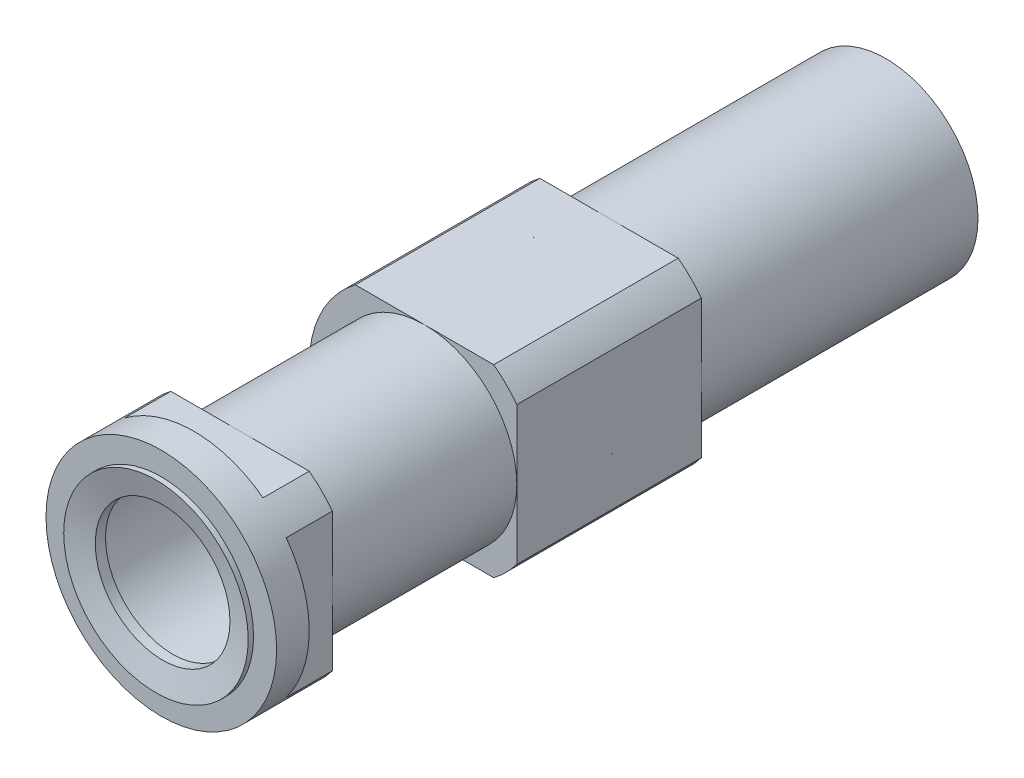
ISO-10303-21;
HEADER;
FILE_DESCRIPTION(('STEP AP214'),'2;1');
FILE_NAME('part.step','',(''),(''),'','','');
FILE_SCHEMA(('AUTOMOTIVE_DESIGN { 1 0 10303 214 1 1 1 1 }'));
ENDSEC;
DATA;
#1=APPLICATION_CONTEXT('core data for automotive mechanical design processes');
#2=APPLICATION_PROTOCOL_DEFINITION('international standard','automotive_design',2000,#1);
#3=PRODUCT_CONTEXT('',#1,'mechanical');
#4=PRODUCT('Part','Part','',(#3));
#5=PRODUCT_RELATED_PRODUCT_CATEGORY('part','',(#4));
#6=PRODUCT_DEFINITION_FORMATION('','',#4);
#7=PRODUCT_DEFINITION_CONTEXT('part definition',#1,'design');
#8=PRODUCT_DEFINITION('design','',#6,#7);
#9=PRODUCT_DEFINITION_SHAPE('','',#8);
#10=(LENGTH_UNIT() NAMED_UNIT(*) SI_UNIT(.MILLI.,.METRE.));
#11=(NAMED_UNIT(*) PLANE_ANGLE_UNIT() SI_UNIT($,.RADIAN.));
#12=(NAMED_UNIT(*) SI_UNIT($,.STERADIAN.) SOLID_ANGLE_UNIT());
#13=UNCERTAINTY_MEASURE_WITH_UNIT(LENGTH_MEASURE(1.E-05),#10,'distance_accuracy_value','');
#14=(GEOMETRIC_REPRESENTATION_CONTEXT(3) GLOBAL_UNCERTAINTY_ASSIGNED_CONTEXT((#13)) GLOBAL_UNIT_ASSIGNED_CONTEXT((#10,
#11,#12)) REPRESENTATION_CONTEXT('',''));
#15=CARTESIAN_POINT('',(0.,0.,0.));
#16=DIRECTION('',(0.,0.,1.));
#17=DIRECTION('',(1.,0.,0.));
#18=AXIS2_PLACEMENT_3D('',#15,#16,#17);
#19=CARTESIAN_POINT('',(0.,0.,63.5));
#20=DIRECTION('',(0.,0.,-1.));
#21=DIRECTION('',(-1.,0.,0.));
#22=AXIS2_PLACEMENT_3D('',#19,#20,#21);
#23=CYLINDRICAL_SURFACE('',#22,15.875);
#24=DIRECTION('',(0.,0.,-1.));
#25=VECTOR('',#24,1.);
#26=CARTESIAN_POINT('',(9.52500000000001,-12.7,82.8127710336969));
#27=LINE('',#26,#25);
#28=CARTESIAN_POINT('',(9.52500000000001,-12.7,63.5));
#29=VERTEX_POINT('',#28);
#30=CARTESIAN_POINT('',(9.52500000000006,-12.7,38.1));
#31=VERTEX_POINT('',#30);
#32=EDGE_CURVE('E181',#29,#31,#27,.T.);
#33=ORIENTED_EDGE('',*,*,#32,.T.);
#34=CARTESIAN_POINT('',(0.,0.,38.1));
#35=DIRECTION('',(0.,0.,-1.));
#36=DIRECTION('',(-1.,0.,0.));
#37=AXIS2_PLACEMENT_3D('',#34,#35,#36);
#38=CIRCLE('',#37,15.875);
#39=CARTESIAN_POINT('',(12.7000000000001,-9.52500000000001,38.1));
#40=VERTEX_POINT('',#39);
#41=EDGE_CURVE('E198',#40,#31,#38,.T.);
#42=ORIENTED_EDGE('',*,*,#41,.F.);
#43=DIRECTION('',(0.,0.,-1.));
#44=VECTOR('',#43,1.);
#45=CARTESIAN_POINT('',(12.7,-9.52500000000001,82.8127710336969));
#46=LINE('',#45,#44);
#47=CARTESIAN_POINT('',(12.7,-9.52500000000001,63.5));
#48=VERTEX_POINT('',#47);
#49=EDGE_CURVE('E323',#48,#40,#46,.T.);
#50=ORIENTED_EDGE('',*,*,#49,.F.);
#51=CARTESIAN_POINT('',(0.,0.,63.5));
#52=DIRECTION('',(0.,0.,-1.));
#53=DIRECTION('',(-1.,0.,0.));
#54=AXIS2_PLACEMENT_3D('',#51,#52,#53);
#55=CIRCLE('',#54,15.875);
#56=EDGE_CURVE('E211',#48,#29,#55,.T.);
#57=ORIENTED_EDGE('',*,*,#56,.T.);
#58=EDGE_LOOP('',(#33,#42,#50,#57));
#59=FACE_BOUND('',#58,.T.);
#60=ADVANCED_FACE('F40',(#59),#23,.T.);
#61=CARTESIAN_POINT('',(0.,0.,63.5));
#62=DIRECTION('',(0.,0.,-1.));
#63=DIRECTION('',(-1.,0.,0.));
#64=AXIS2_PLACEMENT_3D('',#61,#62,#63);
#65=PLANE('',#64);
#66=CARTESIAN_POINT('',(-9.52499999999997,-12.7,63.5000000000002));
#67=VERTEX_POINT('',#66);
#68=CARTESIAN_POINT('',(-9.52499999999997,12.7,63.5000000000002));
#69=VERTEX_POINT('',#68);
#70=EDGE_CURVE('E215',#67,#69,#55,.T.);
#71=ORIENTED_EDGE('',*,*,#70,.F.);
#72=DIRECTION('',(-1.,0.,0.));
#73=VECTOR('',#72,1.);
#74=CARTESIAN_POINT('',(9.52500000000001,-12.7,63.5));
#75=LINE('',#74,#73);
#76=CARTESIAN_POINT('',(0.,-12.7,63.5));
#77=VERTEX_POINT('',#76);
#78=EDGE_CURVE('E177',#77,#67,#75,.T.);
#79=ORIENTED_EDGE('',*,*,#78,.F.);
#80=CARTESIAN_POINT('',(0.,0.,63.5));
#81=DIRECTION('',(0.,0.,-1.));
#82=DIRECTION('',(-1.,0.,0.));
#83=AXIS2_PLACEMENT_3D('',#80,#81,#82);
#84=CIRCLE('',#83,12.7);
#85=CARTESIAN_POINT('',(0.,12.7,63.5));
#86=VERTEX_POINT('',#85);
#87=EDGE_CURVE('E221',#77,#86,#84,.T.);
#88=ORIENTED_EDGE('',*,*,#87,.T.);
#89=DIRECTION('',(1.,0.,0.));
#90=VECTOR('',#89,1.);
#91=CARTESIAN_POINT('',(9.52500000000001,12.7,63.5));
#92=LINE('',#91,#90);
#93=EDGE_CURVE('E332',#69,#86,#92,.T.);
#94=ORIENTED_EDGE('',*,*,#93,.F.);
#95=EDGE_LOOP('',(#71,#79,#88,#94));
#96=FACE_BOUND('',#95,.T.);
#97=ADVANCED_FACE('F376',(#96),#65,.F.);
#98=CARTESIAN_POINT('',(0.,0.,38.1));
#99=DIRECTION('',(0.,0.,-1.));
#100=DIRECTION('',(-1.,0.,0.));
#101=AXIS2_PLACEMENT_3D('',#98,#99,#100);
#102=PLANE('',#101);
#103=DIRECTION('',(1.,0.,0.));
#104=VECTOR('',#103,1.);
#105=CARTESIAN_POINT('',(9.52500000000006,-12.7,38.1));
#106=LINE('',#105,#104);
#107=CARTESIAN_POINT('',(-9.525,-12.7,38.1000000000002));
#108=VERTEX_POINT('',#107);
#109=CARTESIAN_POINT('',(0.,-12.7,38.1));
#110=VERTEX_POINT('',#109);
#111=EDGE_CURVE('E59',#108,#110,#106,.T.);
#112=ORIENTED_EDGE('',*,*,#111,.F.);
#113=CARTESIAN_POINT('',(-9.525,12.7,38.1000000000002));
#114=VERTEX_POINT('',#113);
#115=EDGE_CURVE('E187',#108,#114,#38,.T.);
#116=ORIENTED_EDGE('',*,*,#115,.T.);
#117=DIRECTION('',(-1.,0.,0.));
#118=VECTOR('',#117,1.);
#119=CARTESIAN_POINT('',(9.52500000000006,12.7,38.1));
#120=LINE('',#119,#118);
#121=CARTESIAN_POINT('',(0.,12.7,38.1));
#122=VERTEX_POINT('',#121);
#123=EDGE_CURVE('E340',#122,#114,#120,.T.);
#124=ORIENTED_EDGE('',*,*,#123,.F.);
#125=CARTESIAN_POINT('',(0.,0.,38.1));
#126=DIRECTION('',(0.,0.,-1.));
#127=DIRECTION('',(-1.,0.,0.));
#128=AXIS2_PLACEMENT_3D('',#125,#126,#127);
#129=CIRCLE('',#128,12.7);
#130=EDGE_CURVE('E189',#110,#122,#129,.T.);
#131=ORIENTED_EDGE('',*,*,#130,.F.);
#132=EDGE_LOOP('',(#112,#116,#124,#131));
#133=FACE_BOUND('',#132,.T.);
#134=ADVANCED_FACE('F185',(#133),#102,.T.);
#135=CARTESIAN_POINT('',(9.52500000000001,12.7,63.5));
#136=VERTEX_POINT('',#135);
#137=CARTESIAN_POINT('',(12.7,9.52500000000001,63.5));
#138=VERTEX_POINT('',#137);
#139=EDGE_CURVE('E202',#136,#138,#55,.T.);
#140=ORIENTED_EDGE('',*,*,#139,.F.);
#141=EDGE_CURVE('E67',#86,#136,#92,.T.);
#142=ORIENTED_EDGE('',*,*,#141,.F.);
#143=CARTESIAN_POINT('',(12.7,0.,63.5));
#144=VERTEX_POINT('',#143);
#145=EDGE_CURVE('E222',#86,#144,#84,.T.);
#146=ORIENTED_EDGE('',*,*,#145,.T.);
#147=DIRECTION('',(0.,-1.,0.));
#148=VECTOR('',#147,1.);
#149=CARTESIAN_POINT('',(12.7,9.52500000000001,63.5));
#150=LINE('',#149,#148);
#151=EDGE_CURVE('E316',#138,#144,#150,.T.);
#152=ORIENTED_EDGE('',*,*,#151,.F.);
#153=EDGE_LOOP('',(#140,#142,#146,#152));
#154=FACE_BOUND('',#153,.T.);
#155=ADVANCED_FACE('F369',(#154),#65,.F.);
#156=CARTESIAN_POINT('',(9.52500000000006,12.7,38.1));
#157=VERTEX_POINT('',#156);
#158=EDGE_CURVE('E336',#157,#122,#120,.T.);
#159=ORIENTED_EDGE('',*,*,#158,.F.);
#160=CARTESIAN_POINT('',(12.7000000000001,9.52500000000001,38.1));
#161=VERTEX_POINT('',#160);
#162=EDGE_CURVE('E199',#157,#161,#38,.T.);
#163=ORIENTED_EDGE('',*,*,#162,.T.);
#164=DIRECTION('',(0.,1.,0.));
#165=VECTOR('',#164,1.);
#166=CARTESIAN_POINT('',(12.7000000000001,9.52500000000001,38.1));
#167=LINE('',#166,#165);
#168=CARTESIAN_POINT('',(12.7000000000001,0.,38.1));
#169=VERTEX_POINT('',#168);
#170=EDGE_CURVE('E331',#169,#161,#167,.T.);
#171=ORIENTED_EDGE('',*,*,#170,.F.);
#172=EDGE_CURVE('E214',#122,#169,#129,.T.);
#173=ORIENTED_EDGE('',*,*,#172,.F.);
#174=EDGE_LOOP('',(#159,#163,#171,#173));
#175=FACE_BOUND('',#174,.T.);
#176=ADVANCED_FACE('F361',(#175),#102,.T.);
#177=DIRECTION('',(0.,0.,-1.));
#178=VECTOR('',#177,1.);
#179=CARTESIAN_POINT('',(-9.525,-12.7,82.8127710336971));
#180=LINE('',#179,#178);
#181=EDGE_CURVE('E174',#67,#108,#180,.T.);
#182=ORIENTED_EDGE('',*,*,#181,.F.);
#183=ORIENTED_EDGE('',*,*,#70,.T.);
#184=DIRECTION('',(0.,0.,-1.));
#185=VECTOR('',#184,1.);
#186=CARTESIAN_POINT('',(-9.525,12.7,82.8127710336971));
#187=LINE('',#186,#185);
#188=EDGE_CURVE('E197',#69,#114,#187,.T.);
#189=ORIENTED_EDGE('',*,*,#188,.T.);
#190=ORIENTED_EDGE('',*,*,#115,.F.);
#191=EDGE_LOOP('',(#182,#183,#189,#190));
#192=FACE_BOUND('',#191,.T.);
#193=CARTESIAN_POINT('',(-15.875,0.,57.15));
#194=CARTESIAN_POINT('',(-15.8749992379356,0.170723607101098,57.1499990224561));
#195=CARTESIAN_POINT('',(-15.8722383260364,0.341513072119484,57.1431054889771));
#196=CARTESIAN_POINT('',(-15.8612638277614,0.681883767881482,57.1155934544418));
#197=CARTESIAN_POINT('',(-15.853046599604,0.851464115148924,57.0949657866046));
#198=CARTESIAN_POINT('',(-15.8313537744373,1.18845576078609,57.0401340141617));
#199=CARTESIAN_POINT('',(-15.8178669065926,1.3558616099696,57.0059008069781));
#200=CARTESIAN_POINT('',(-15.7859860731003,1.68699508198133,56.9241852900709));
#201=CARTESIAN_POINT('',(-15.7675901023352,1.85072117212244,56.8766975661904));
#202=CARTESIAN_POINT('',(-15.7264467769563,2.17272777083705,56.7691257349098));
#203=CARTESIAN_POINT('',(-15.7037158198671,2.33102622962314,56.7090890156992));
#204=CARTESIAN_POINT('',(-15.6544202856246,2.64188036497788,56.5768084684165));
#205=CARTESIAN_POINT('',(-15.6278542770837,2.79443387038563,56.5045600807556));
#206=CARTESIAN_POINT('',(-15.5715631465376,3.09274308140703,56.3484905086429));
#207=CARTESIAN_POINT('',(-15.5418404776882,3.23850394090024,56.2646782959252));
#208=CARTESIAN_POINT('',(-15.4799301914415,3.52257915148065,56.0860312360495));
#209=CARTESIAN_POINT('',(-15.4477416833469,3.66089078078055,55.9911923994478));
#210=CARTESIAN_POINT('',(-15.3457887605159,4.07494983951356,55.6825160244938));
#211=CARTESIAN_POINT('',(-15.2731105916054,4.33717782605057,55.4511120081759));
#212=CARTESIAN_POINT('',(-15.1276056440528,4.82027556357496,54.9483793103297));
#213=CARTESIAN_POINT('',(-15.0547788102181,5.04112508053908,54.6770312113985));
#214=CARTESIAN_POINT('',(-14.9497242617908,5.34165986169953,54.2383934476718));
#215=CARTESIAN_POINT('',(-14.9147052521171,5.43842052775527,54.0832303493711));
#216=CARTESIAN_POINT('',(-14.8478282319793,5.61843710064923,53.7646412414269));
#217=CARTESIAN_POINT('',(-14.81596892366,5.70169856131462,53.6012186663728));
#218=CARTESIAN_POINT('',(-14.7564512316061,5.8540128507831,53.2671334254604));
#219=CARTESIAN_POINT('',(-14.7287931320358,5.92306471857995,53.0964702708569));
#220=CARTESIAN_POINT('',(-14.6786563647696,6.04624662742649,52.7491846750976));
#221=CARTESIAN_POINT('',(-14.6561751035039,6.10038414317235,52.5725652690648));
#222=CARTESIAN_POINT('',(-14.6180821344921,6.19109128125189,52.2226969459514));
#223=CARTESIAN_POINT('',(-14.6022072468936,6.22834071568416,52.0496529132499));
#224=CARTESIAN_POINT('',(-14.5764918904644,6.28828888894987,51.7006920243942));
#225=CARTESIAN_POINT('',(-14.5666486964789,6.31099419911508,51.524776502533));
#226=CARTESIAN_POINT('',(-14.5533483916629,6.34160512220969,51.1714581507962));
#227=CARTESIAN_POINT('',(-14.54988993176,6.34951386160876,50.9940556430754));
#228=CARTESIAN_POINT('',(-14.5494847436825,6.35044257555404,50.6392083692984));
#229=CARTESIAN_POINT('',(-14.5525377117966,6.34346324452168,50.461763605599));
#230=CARTESIAN_POINT('',(-14.5646013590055,6.31571187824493,50.1206717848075));
#231=CARTESIAN_POINT('',(-14.5731808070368,6.29593775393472,49.9569270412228));
#232=CARTESIAN_POINT('',(-14.5956012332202,6.24378530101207,49.6317684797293));
#233=CARTESIAN_POINT('',(-14.6094439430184,6.21140282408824,49.4703554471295));
#234=CARTESIAN_POINT('',(-14.641959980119,6.13436035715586,49.1510322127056));
#235=CARTESIAN_POINT('',(-14.6606321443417,6.08970332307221,48.9931211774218));
#236=CARTESIAN_POINT('',(-14.7022643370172,5.9884923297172,48.6816794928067));
#237=CARTESIAN_POINT('',(-14.7252260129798,5.93193379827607,48.5281505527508));
#238=CARTESIAN_POINT('',(-14.775282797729,5.80614447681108,48.223393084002));
#239=CARTESIAN_POINT('',(-14.8024514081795,5.73668280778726,48.0722720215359));
#240=CARTESIAN_POINT('',(-14.8598291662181,5.58637380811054,47.7763465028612));
#241=CARTESIAN_POINT('',(-14.8900393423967,5.5055226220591,47.6315442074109));
#242=CARTESIAN_POINT('',(-14.9527027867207,5.33298475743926,47.3490330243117));
#243=CARTESIAN_POINT('',(-14.9851563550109,5.24129662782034,47.2113250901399));
#244=CARTESIAN_POINT('',(-15.051491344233,5.04764379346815,46.9436964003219));
#245=CARTESIAN_POINT('',(-15.0853728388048,4.94567855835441,46.8137760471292));
#246=CARTESIAN_POINT('',(-15.1564013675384,4.72374065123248,46.5526041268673));
#247=CARTESIAN_POINT('',(-15.1935978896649,4.60298473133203,46.422030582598));
#248=CARTESIAN_POINT('',(-15.2676831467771,4.35094499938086,46.1714638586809));
#249=CARTESIAN_POINT('',(-15.3045719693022,4.21966430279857,46.0514675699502));
#250=CARTESIAN_POINT('',(-15.3770942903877,3.94721120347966,45.8226831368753));
#251=CARTESIAN_POINT('',(-15.4127270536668,3.80603314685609,45.7139014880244));
#252=CARTESIAN_POINT('',(-15.4817555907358,3.51472105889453,45.5084033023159));
#253=CARTESIAN_POINT('',(-15.515152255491,3.36459064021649,45.411681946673));
#254=CARTESIAN_POINT('',(-15.5794769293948,3.05308384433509,45.229145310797));
#255=CARTESIAN_POINT('',(-15.6103411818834,2.89154120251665,45.1435908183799));
#256=CARTESIAN_POINT('',(-15.6679390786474,2.56113556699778,44.9865218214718));
#257=CARTESIAN_POINT('',(-15.6946743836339,2.39227555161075,44.9150016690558));
#258=CARTESIAN_POINT('',(-15.7432461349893,2.04840609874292,44.7866645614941));
#259=CARTESIAN_POINT('',(-15.7650835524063,1.87339788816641,44.7298446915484));
#260=CARTESIAN_POINT('',(-15.8032107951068,1.5185472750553,44.6314990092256));
#261=CARTESIAN_POINT('',(-15.8195010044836,1.33870520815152,44.5899721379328));
#262=CARTESIAN_POINT('',(-15.8452497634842,0.986412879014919,44.524678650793));
#263=CARTESIAN_POINT('',(-15.8550557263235,0.814155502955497,44.5000059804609));
#264=CARTESIAN_POINT('',(-15.8690462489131,0.467973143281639,44.4648784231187));
#265=CARTESIAN_POINT('',(-15.8732310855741,0.294048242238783,44.4544228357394));
#266=CARTESIAN_POINT('',(-15.8758620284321,-0.0540764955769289,44.4478445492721));
#267=CARTESIAN_POINT('',(-15.8743094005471,-0.228276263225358,44.4517186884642));
#268=CARTESIAN_POINT('',(-15.8655117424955,-0.575622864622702,44.4737499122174));
#269=CARTESIAN_POINT('',(-15.858266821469,-0.7487697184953,44.4919067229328));
#270=CARTESIAN_POINT('',(-15.838739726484,-1.08489756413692,44.5411634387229));
#271=CARTESIAN_POINT('',(-15.8266999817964,-1.24798436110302,44.5716413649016));
#272=CARTESIAN_POINT('',(-15.7979139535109,-1.57093270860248,44.6451560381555));
#273=CARTESIAN_POINT('',(-15.7811661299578,-1.73079318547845,44.6881968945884));
#274=CARTESIAN_POINT('',(-15.7433819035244,-2.04615946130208,44.7864318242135));
#275=CARTESIAN_POINT('',(-15.7223466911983,-2.20166645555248,44.8416225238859));
#276=CARTESIAN_POINT('',(-15.6764800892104,-2.50749236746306,44.9637251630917));
#277=CARTESIAN_POINT('',(-15.6516472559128,-2.65780928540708,45.0306415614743));
#278=CARTESIAN_POINT('',(-15.5979717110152,-2.95679977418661,45.1778620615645));
#279=CARTESIAN_POINT('',(-15.5690305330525,-3.10528655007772,45.2585095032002));
#280=CARTESIAN_POINT('',(-15.5084314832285,-3.39500995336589,45.4311217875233));
#281=CARTESIAN_POINT('',(-15.4767726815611,-3.53624407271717,45.5230905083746));
#282=CARTESIAN_POINT('',(-15.4114952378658,-3.81068759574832,45.7177302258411));
#283=CARTESIAN_POINT('',(-15.377876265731,-3.94389564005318,45.8204030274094));
#284=CARTESIAN_POINT('',(-15.3094769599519,-4.20158482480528,46.0358221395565));
#285=CARTESIAN_POINT('',(-15.2746965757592,-4.32606558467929,46.1485688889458));
#286=CARTESIAN_POINT('',(-15.2024813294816,-4.57360830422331,46.3913026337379));
#287=CARTESIAN_POINT('',(-15.1650232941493,-4.69602961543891,46.5219369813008));
#288=CARTESIAN_POINT('',(-15.090762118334,-4.92945473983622,46.7931338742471));
#289=CARTESIAN_POINT('',(-15.0539587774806,-5.04046209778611,46.933693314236));
#290=CARTESIAN_POINT('',(-14.9820123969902,-5.25045310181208,47.224058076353));
#291=CARTESIAN_POINT('',(-14.946870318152,-5.34942984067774,47.3738686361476));
#292=CARTESIAN_POINT('',(-14.8793212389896,-5.53453989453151,47.6817289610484));
#293=CARTESIAN_POINT('',(-14.8469130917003,-5.62067860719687,47.8397752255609));
#294=CARTESIAN_POINT('',(-14.7855120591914,-5.78028102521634,48.1648585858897));
#295=CARTESIAN_POINT('',(-14.7565574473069,-5.85360625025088,48.3319710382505));
#296=CARTESIAN_POINT('',(-14.7034405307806,-5.98577798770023,48.6724897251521));
#297=CARTESIAN_POINT('',(-14.679276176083,-6.04463069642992,48.8458932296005));
#298=CARTESIAN_POINT('',(-14.6365966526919,-6.14725596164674,49.1977181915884));
#299=CARTESIAN_POINT('',(-14.6180792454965,-6.19103449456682,49.3761376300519));
#300=CARTESIAN_POINT('',(-14.5873801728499,-6.26302669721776,49.7366229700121));
#301=CARTESIAN_POINT('',(-14.5751979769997,-6.29124166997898,49.9186885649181));
#302=CARTESIAN_POINT('',(-14.5582759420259,-6.33029550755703,50.2717106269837));
#303=CARTESIAN_POINT('',(-14.5530633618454,-6.34223928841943,50.4425230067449));
#304=CARTESIAN_POINT('',(-14.5486808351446,-6.35228648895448,50.7846294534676));
#305=CARTESIAN_POINT('',(-14.5495106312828,-6.35039049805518,50.9559234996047));
#306=CARTESIAN_POINT('',(-14.5571835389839,-6.33278160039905,51.2976402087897));
#307=CARTESIAN_POINT('',(-14.5640259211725,-6.31707036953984,51.4680629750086));
#308=CARTESIAN_POINT('',(-14.5834872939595,-6.27201114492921,51.8067583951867));
#309=CARTESIAN_POINT('',(-14.596106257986,-6.2426632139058,51.9750310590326));
#310=CARTESIAN_POINT('',(-14.6260871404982,-6.17208269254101,52.3015581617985));
#311=CARTESIAN_POINT('',(-14.6432401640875,-6.13136993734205,52.459944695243));
#312=CARTESIAN_POINT('',(-14.6819761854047,-6.03802553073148,52.7726595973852));
#313=CARTESIAN_POINT('',(-14.7035606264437,-5.98538999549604,52.926986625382));
#314=CARTESIAN_POINT('',(-14.7505437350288,-5.86864882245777,53.2306184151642));
#315=CARTESIAN_POINT('',(-14.7759418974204,-5.80454470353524,53.3799238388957));
#316=CARTESIAN_POINT('',(-14.8298713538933,-5.66534290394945,53.6727524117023));
#317=CARTESIAN_POINT('',(-14.8584037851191,-5.5902412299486,53.816273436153));
#318=CARTESIAN_POINT('',(-14.9510024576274,-5.34003416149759,54.2529865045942));
#319=CARTESIAN_POINT('',(-15.0192861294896,-5.14662610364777,54.5350542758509));
#320=CARTESIAN_POINT('',(-15.1594916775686,-4.71764629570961,55.0640788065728));
#321=CARTESIAN_POINT('',(-15.2314146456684,-4.48206183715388,55.3110249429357));
#322=CARTESIAN_POINT('',(-15.3389694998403,-4.09285023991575,55.6583967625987));
#323=CARTESIAN_POINT('',(-15.3758635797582,-3.95232800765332,55.7733908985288));
#324=CARTESIAN_POINT('',(-15.4476649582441,-3.66164523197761,55.9911263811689));
#325=CARTESIAN_POINT('',(-15.4825729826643,-3.51148825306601,56.0938722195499));
#326=CARTESIAN_POINT('',(-15.5494698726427,-3.20228984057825,56.2864424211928));
#327=CARTESIAN_POINT('',(-15.5814559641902,-3.04324019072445,56.3762545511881));
#328=CARTESIAN_POINT('',(-15.6415591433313,-2.71747396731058,56.5420568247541));
#329=CARTESIAN_POINT('',(-15.6696779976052,-2.55076094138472,56.6180532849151));
#330=CARTESIAN_POINT('',(-15.7207829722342,-2.2138450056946,56.7543101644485));
#331=CARTESIAN_POINT('',(-15.7438529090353,-2.04376017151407,56.814830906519));
#332=CARTESIAN_POINT('',(-15.7848259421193,-1.69855327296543,56.9212759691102));
#333=CARTESIAN_POINT('',(-15.8027314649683,-1.52343361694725,56.9672071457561));
#334=CARTESIAN_POINT('',(-15.8328255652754,-1.16989732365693,57.0439156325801));
#335=CARTESIAN_POINT('',(-15.8450284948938,-0.991490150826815,57.0747309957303));
#336=CARTESIAN_POINT('',(-15.8634123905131,-0.632479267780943,57.1210112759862));
#337=CARTESIAN_POINT('',(-15.8695979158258,-0.451877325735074,57.1364878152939));
#338=CARTESIAN_POINT('',(-15.8734579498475,-0.225838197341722,57.1461438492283));
#339=CARTESIAN_POINT('',(-15.8740359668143,-0.180685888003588,57.1475895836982));
#340=CARTESIAN_POINT('',(-15.8748070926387,-0.090357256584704,57.1495177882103));
#341=CARTESIAN_POINT('',(-15.8750002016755,-0.0451809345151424,57.1500002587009));
#342=CARTESIAN_POINT('',(-15.875,0.,57.15));
#343=B_SPLINE_CURVE_WITH_KNOTS('',3,(#193,#194,#195,#196,#197,#198,#199,#200,#201,#202,#203,
#204,#205,#206,#207,#208,#209,#210,#211,#212,#213,#214,#215,#216,#217,#218,#219,#220,#221,#222,
#223,#224,#225,#226,#227,#228,#229,#230,#231,#232,#233,#234,#235,#236,#237,#238,#239,#240,#241,
#242,#243,#244,#245,#246,#247,#248,#249,#250,#251,#252,#253,#254,#255,#256,#257,#258,#259,#260,
#261,#262,#263,#264,#265,#266,#267,#268,#269,#270,#271,#272,#273,#274,#275,#276,#277,#278,#279,
#280,#281,#282,#283,#284,#285,#286,#287,#288,#289,#290,#291,#292,#293,#294,#295,#296,#297,#298,
#299,#300,#301,#302,#303,#304,#305,#306,#307,#308,#309,#310,#311,#312,#313,#314,#315,#316,#317,
#318,#319,#320,#321,#322,#323,#324,#325,#326,#327,#328,#329,#330,#331,#332,#333,#334,#335,#336,
#337,#338,#339,#340,#341,#342),.UNSPECIFIED.,.T.,.F.,(4,2,2,2,2,2,2,2,2,2,2,2,2,2,2,2,2,2,2,2,2,
2,2,2,2,2,2,2,2,2,2,2,2,2,2,2,2,2,2,2,2,2,2,2,2,2,2,2,2,2,2,2,2,2,2,2,2,2,2,2,2,2,2,2,2,2,2,2,2,
2,2,2,2,2,4),(0.,0.512124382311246,1.02459092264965,1.5381595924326,2.05193835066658,
2.56381091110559,3.07587501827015,3.58754405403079,4.09939879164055,5.16602823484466,
6.23317790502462,6.79113951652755,7.34887098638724,7.90664016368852,8.46412929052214,
8.99658033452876,9.52879063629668,10.0608884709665,10.5929614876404,11.0878534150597,
11.582908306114,12.0778440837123,12.5729703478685,13.0780018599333,13.5832047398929,
14.0884753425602,14.5937720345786,15.1382522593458,15.6825719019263,16.2272050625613,
16.771619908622,17.3270693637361,17.8822948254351,18.4374101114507,18.9924869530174,
19.5146952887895,20.0368778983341,20.5589453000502,21.0810026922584,21.5794682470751,
22.0780970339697,22.5765875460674,23.0752680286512,23.589011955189,24.1029323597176,
24.6169395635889,25.1309691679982,25.6790618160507,26.2269837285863,26.7752187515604,
27.3232226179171,27.8768249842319,28.4301899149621,28.9833352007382,29.5364341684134,
30.0497057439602,30.562955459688,31.0761429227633,31.5893280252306,32.082076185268,
32.5749850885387,33.0678287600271,33.5608518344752,34.6023735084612,35.6442095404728,
36.1995036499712,36.7545934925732,37.3102049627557,37.8655617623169,38.4108495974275,
38.95588080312,39.4995327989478,40.0427725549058,40.178303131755,40.3138336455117),.UNSPECIFIED.);
#344=CARTESIAN_POINT('',(-15.875,0.,57.15));
#345=VERTEX_POINT('',#344);
#346=EDGE_CURVE('E12',#345,#345,#343,.T.);
#347=ORIENTED_EDGE('',*,*,#346,.F.);
#348=EDGE_LOOP('',(#347));
#349=FACE_BOUND('',#348,.T.);
#350=ADVANCED_FACE('F194',(#192,#349),#23,.T.);
#351=CARTESIAN_POINT('',(-15.875,0.,50.8));
#352=DIRECTION('',(1.,0.,0.));
#353=DIRECTION('',(0.,0.,-1.));
#354=AXIS2_PLACEMENT_3D('',#351,#352,#353);
#355=CYLINDRICAL_SURFACE('',#354,3.175);
#356=CARTESIAN_POINT('',(-11.049,0.,47.625));
#357=CARTESIAN_POINT('',(-11.0489979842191,-0.174511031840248,47.6250029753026));
#358=CARTESIAN_POINT('',(-11.0448255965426,-0.349052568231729,47.6394357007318));
#359=CARTESIAN_POINT('',(-11.0285877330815,-0.693074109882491,47.6966620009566));
#360=CARTESIAN_POINT('',(-11.0165193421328,-0.862552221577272,47.7394660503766));
#361=CARTESIAN_POINT('',(-10.9858156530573,-1.19143384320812,47.8519033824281));
#362=CARTESIAN_POINT('',(-10.9671895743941,-1.35085112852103,47.9214990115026));
#363=CARTESIAN_POINT('',(-10.9253190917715,-1.65575298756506,48.0853952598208));
#364=CARTESIAN_POINT('',(-10.9020741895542,-1.80123605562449,48.1796985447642));
#365=CARTESIAN_POINT('',(-10.8527668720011,-2.07800439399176,48.3929750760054));
#366=CARTESIAN_POINT('',(-10.8266503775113,-2.20886700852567,48.512484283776));
#367=CARTESIAN_POINT('',(-10.7748754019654,-2.4489960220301,48.7716366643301));
#368=CARTESIAN_POINT('',(-10.7492169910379,-2.55825913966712,48.9112828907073));
#369=CARTESIAN_POINT('',(-10.7006988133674,-2.75424699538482,49.2102417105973));
#370=CARTESIAN_POINT('',(-10.677906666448,-2.84046753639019,49.3698968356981));
#371=CARTESIAN_POINT('',(-10.6385048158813,-2.98466813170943,49.7021999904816));
#372=CARTESIAN_POINT('',(-10.6218937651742,-3.04265434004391,49.8748451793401));
#373=CARTESIAN_POINT('',(-10.5972963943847,-3.1272381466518,50.2235060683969));
#374=CARTESIAN_POINT('',(-10.5890977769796,-3.15461003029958,50.3993185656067));
#375=CARTESIAN_POINT('',(-10.5816208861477,-3.17960462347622,50.7532166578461));
#376=CARTESIAN_POINT('',(-10.5823406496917,-3.17723387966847,50.9313017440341));
#377=CARTESIAN_POINT('',(-10.5924303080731,-3.14342122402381,51.2784949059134));
#378=CARTESIAN_POINT('',(-10.6015155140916,-3.11293603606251,51.4477057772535));
#379=CARTESIAN_POINT('',(-10.6268536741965,-3.02530032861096,51.7785027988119));
#380=CARTESIAN_POINT('',(-10.6431072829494,-2.96814737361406,51.9400882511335));
#381=CARTESIAN_POINT('',(-10.681187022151,-2.8280648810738,52.2534476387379));
#382=CARTESIAN_POINT('',(-10.7030817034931,-2.74481530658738,52.4050698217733));
#383=CARTESIAN_POINT('',(-10.7499421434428,-2.55512543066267,52.6925190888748));
#384=CARTESIAN_POINT('',(-10.7749085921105,-2.44867991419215,52.8283426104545));
#385=CARTESIAN_POINT('',(-10.8262660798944,-2.21081309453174,53.0857815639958));
#386=CARTESIAN_POINT('',(-10.8526751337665,-2.07859400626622,53.2066574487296));
#387=CARTESIAN_POINT('',(-10.9030944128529,-1.79543431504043,53.4246847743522));
#388=CARTESIAN_POINT('',(-10.9271045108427,-1.64449272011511,53.5218349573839));
#389=CARTESIAN_POINT('',(-10.9702101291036,-1.32690694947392,53.6900528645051));
#390=CARTESIAN_POINT('',(-10.989276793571,-1.16017800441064,53.7609684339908));
#391=CARTESIAN_POINT('',(-11.0201393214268,-0.816487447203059,53.8735401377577));
#392=CARTESIAN_POINT('',(-11.0319370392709,-0.6395284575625,53.9152037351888));
#393=CARTESIAN_POINT('',(-11.0466440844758,-0.286697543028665,53.9668851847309));
#394=CARTESIAN_POINT('',(-11.0498351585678,-0.110984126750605,53.9779065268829));
#395=CARTESIAN_POINT('',(-11.0477894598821,0.239787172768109,53.9707870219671));
#396=CARTESIAN_POINT('',(-11.0425537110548,0.414845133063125,53.9526497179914));
#397=CARTESIAN_POINT('',(-11.0244262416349,0.755629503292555,53.8885441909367));
#398=CARTESIAN_POINT('',(-11.0116930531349,0.921473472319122,53.8431518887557));
#399=CARTESIAN_POINT('',(-10.9800314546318,1.24316441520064,53.7265083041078));
#400=CARTESIAN_POINT('',(-10.9611023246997,1.3990102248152,53.6552540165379));
#401=CARTESIAN_POINT('',(-10.9185094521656,1.70005482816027,53.4871560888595));
#402=CARTESIAN_POINT('',(-10.8947514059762,1.84494707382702,53.3897879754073));
#403=CARTESIAN_POINT('',(-10.8452370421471,2.11668217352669,53.1728719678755));
#404=CARTESIAN_POINT('',(-10.8194802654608,2.24352086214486,53.0533189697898));
#405=CARTESIAN_POINT('',(-10.7678069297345,2.47989450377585,52.7907215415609));
#406=CARTESIAN_POINT('',(-10.741913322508,2.58871738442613,52.6470303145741));
#407=CARTESIAN_POINT('',(-10.6938163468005,2.78074232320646,52.3428668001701));
#408=CARTESIAN_POINT('',(-10.6716128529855,2.86394525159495,52.1823950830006));
#409=CARTESIAN_POINT('',(-10.6336692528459,3.00176512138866,51.8498760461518));
#410=CARTESIAN_POINT('',(-10.6178953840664,3.05653181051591,51.6778948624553));
#411=CARTESIAN_POINT('',(-10.5946426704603,3.13619240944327,51.3266216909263));
#412=CARTESIAN_POINT('',(-10.5871612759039,3.16109550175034,51.1473319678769));
#413=CARTESIAN_POINT('',(-10.5815771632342,3.17973391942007,50.7938849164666));
#414=CARTESIAN_POINT('',(-10.5831271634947,3.17462329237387,50.6197930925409));
#415=CARTESIAN_POINT('',(-10.5946047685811,3.13610362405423,50.275064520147));
#416=CARTESIAN_POINT('',(-10.6045320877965,3.10269554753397,50.104427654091));
#417=CARTESIAN_POINT('',(-10.6314227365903,3.0092458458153,49.7731683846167));
#418=CARTESIAN_POINT('',(-10.6483115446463,2.94948585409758,49.6124600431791));
#419=CARTESIAN_POINT('',(-10.6872141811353,2.80524663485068,49.3032236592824));
#420=CARTESIAN_POINT('',(-10.7092289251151,2.72076299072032,49.1546977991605));
#421=CARTESIAN_POINT('',(-10.7568301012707,2.52613352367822,48.8686263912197));
#422=CARTESIAN_POINT('',(-10.7825119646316,2.41521818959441,48.7316202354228));
#423=CARTESIAN_POINT('',(-10.8340644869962,2.172289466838,48.4777905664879));
#424=CARTESIAN_POINT('',(-10.85993519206,2.04027075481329,48.3609721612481));
#425=CARTESIAN_POINT('',(-10.909757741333,1.75473727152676,48.147816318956));
#426=CARTESIAN_POINT('',(-10.9336420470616,1.60075213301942,48.0520916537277));
#427=CARTESIAN_POINT('',(-10.9760204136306,1.27818776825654,47.8880315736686));
#428=CARTESIAN_POINT('',(-10.9945173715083,1.10961644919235,47.8196814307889));
#429=CARTESIAN_POINT('',(-11.0221127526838,0.785138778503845,47.7195474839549));
#430=CARTESIAN_POINT('',(-11.0321161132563,0.630406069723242,47.6841826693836));
#431=CARTESIAN_POINT('',(-11.0455602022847,0.317123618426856,47.6369091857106));
#432=CARTESIAN_POINT('',(-11.0490018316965,0.15857440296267,47.6249972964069));
#433=CARTESIAN_POINT('',(-11.049,0.,47.625));
#434=B_SPLINE_CURVE_WITH_KNOTS('',3,(#356,#357,#358,#359,#360,#361,#362,#363,#364,#365,#366,
#367,#368,#369,#370,#371,#372,#373,#374,#375,#376,#377,#378,#379,#380,#381,#382,#383,#384,#385,
#386,#387,#388,#389,#390,#391,#392,#393,#394,#395,#396,#397,#398,#399,#400,#401,#402,#403,#404,
#405,#406,#407,#408,#409,#410,#411,#412,#413,#414,#415,#416,#417,#418,#419,#420,#421,#422,#423,
#424,#425,#426,#427,#428,#429,#430,#431,#432,#433),.UNSPECIFIED.,.T.,.F.,(4,2,2,2,2,2,2,2,2,2,2,
2,2,2,2,2,2,2,2,2,2,2,2,2,2,2,2,2,2,2,2,2,2,2,2,2,2,2,4),(0.,0.522950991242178,1.04609516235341,
1.56850676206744,2.09097474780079,2.62593532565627,3.1609771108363,3.70691280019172,
4.25272944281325,4.78440524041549,5.31596401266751,5.83007603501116,6.34423501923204,
6.86496383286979,7.38580984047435,7.92652247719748,8.46726377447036,9.01109382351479,
9.55478507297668,10.0804488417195,10.6060487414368,11.1209149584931,11.6358410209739,
12.1620036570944,12.6882874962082,13.231998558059,13.775691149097,14.31649080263,
14.8571241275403,15.3771093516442,15.897076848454,16.4116170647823,16.9262492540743,
17.4582411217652,17.9903673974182,18.5363549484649,19.0820483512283,19.5573078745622,
20.0325021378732),.UNSPECIFIED.);
#435=CARTESIAN_POINT('',(-11.049,0.,47.625));
#436=VERTEX_POINT('',#435);
#437=EDGE_CURVE('E203',#436,#436,#434,.T.);
#438=ORIENTED_EDGE('',*,*,#437,.F.);
#439=EDGE_LOOP('',(#438));
#440=FACE_BOUND('',#439,.T.);
#441=CARTESIAN_POINT('',(-13.49375,0.,50.8));
#442=DIRECTION('',(-1.,0.,0.));
#443=DIRECTION('',(0.,0.,1.));
#444=AXIS2_PLACEMENT_3D('',#441,#442,#443);
#445=CIRCLE('',#444,3.175);
#446=CARTESIAN_POINT('',(-13.49375,0.,53.975));
#447=VERTEX_POINT('',#446);
#448=EDGE_CURVE('E309',#447,#447,#445,.F.);
#449=ORIENTED_EDGE('',*,*,#448,.F.);
#450=EDGE_LOOP('',(#449));
#451=FACE_BOUND('',#450,.T.);
#452=ADVANCED_FACE('F396',(#440,#451),#355,.F.);
#453=CARTESIAN_POINT('',(0.,0.,101.6));
#454=DIRECTION('',(0.,0.,-1.));
#455=DIRECTION('',(-1.,0.,0.));
#456=AXIS2_PLACEMENT_3D('',#453,#454,#455);
#457=CYLINDRICAL_SURFACE('',#456,12.7);
#458=CARTESIAN_POINT('',(0.,0.,88.9));
#459=DIRECTION('',(0.,0.,1.));
#460=DIRECTION('',(1.,0.,0.));
#461=AXIS2_PLACEMENT_3D('',#458,#459,#460);
#462=CIRCLE('',#461,12.7);
#463=CARTESIAN_POINT('',(0.,12.7,88.9));
#464=VERTEX_POINT('',#463);
#465=CARTESIAN_POINT('',(-12.7,0.,88.9));
#466=VERTEX_POINT('',#465);
#467=EDGE_CURVE('E256',#464,#466,#462,.T.);
#468=ORIENTED_EDGE('',*,*,#467,.F.);
#469=CARTESIAN_POINT('',(12.7,0.,88.9));
#470=VERTEX_POINT('',#469);
#471=EDGE_CURVE('E261',#470,#464,#462,.T.);
#472=ORIENTED_EDGE('',*,*,#471,.F.);
#473=CARTESIAN_POINT('',(0.,-12.7,88.9));
#474=VERTEX_POINT('',#473);
#475=EDGE_CURVE('E768',#474,#470,#462,.T.);
#476=ORIENTED_EDGE('',*,*,#475,.F.);
#477=EDGE_CURVE('E260',#466,#474,#462,.T.);
#478=ORIENTED_EDGE('',*,*,#477,.F.);
#479=EDGE_LOOP('',(#468,#472,#476,#478));
#480=FACE_BOUND('',#479,.T.);
#481=EDGE_CURVE('E52',#144,#77,#84,.T.);
#482=ORIENTED_EDGE('',*,*,#481,.F.);
#483=ORIENTED_EDGE('',*,*,#145,.F.);
#484=ORIENTED_EDGE('',*,*,#87,.F.);
#485=EDGE_LOOP('',(#482,#483,#484));
#486=FACE_BOUND('',#485,.T.);
#487=ADVANCED_FACE('F477',(#480,#486),#457,.T.);
#488=CARTESIAN_POINT('',(0.,0.,88.9));
#489=DIRECTION('',(0.,0.,1.));
#490=DIRECTION('',(1.,0.,0.));
#491=AXIS2_PLACEMENT_3D('',#488,#489,#490);
#492=CYLINDRICAL_SURFACE('',#491,9.271);
#493=CARTESIAN_POINT('',(0.,0.,99.5582271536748));
#494=DIRECTION('',(0.,0.,1.));
#495=DIRECTION('',(1.,0.,0.));
#496=AXIS2_PLACEMENT_3D('',#493,#494,#495);
#497=CIRCLE('',#496,9.271);
#498=CARTESIAN_POINT('',(9.27100000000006,0.,99.5582271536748));
#499=VERTEX_POINT('',#498);
#500=EDGE_CURVE('E259',#499,#499,#497,.T.);
#501=ORIENTED_EDGE('',*,*,#500,.T.);
#502=EDGE_LOOP('',(#501));
#503=FACE_BOUND('',#502,.T.);
#504=CARTESIAN_POINT('',(0.,0.,98.15322));
#505=DIRECTION('',(0.,0.,-1.));
#506=DIRECTION('',(-1.,0.,0.));
#507=AXIS2_PLACEMENT_3D('',#504,#505,#506);
#508=CIRCLE('',#507,9.271);
#509=CARTESIAN_POINT('',(-9.27099999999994,0.,98.15322));
#510=VERTEX_POINT('',#509);
#511=EDGE_CURVE('E225',#510,#510,#508,.F.);
#512=ORIENTED_EDGE('',*,*,#511,.F.);
#513=EDGE_LOOP('',(#512));
#514=FACE_BOUND('',#513,.T.);
#515=ADVANCED_FACE('F695',(#503,#514),#492,.F.);
#516=CARTESIAN_POINT('',(0.,0.,88.9));
#517=DIRECTION('',(0.,0.,1.));
#518=DIRECTION('',(1.,0.,0.));
#519=AXIS2_PLACEMENT_3D('',#516,#517,#518);
#520=PLANE('',#519);
#521=CARTESIAN_POINT('',(0.,0.,88.9));
#522=DIRECTION('',(0.,0.,1.));
#523=DIRECTION('',(1.,0.,0.));
#524=AXIS2_PLACEMENT_3D('',#521,#522,#523);
#525=CIRCLE('',#524,15.875);
#526=CARTESIAN_POINT('',(12.7,9.52500000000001,88.9));
#527=VERTEX_POINT('',#526);
#528=CARTESIAN_POINT('',(9.525,12.7,88.9));
#529=VERTEX_POINT('',#528);
#530=EDGE_CURVE('E255',#527,#529,#525,.T.);
#531=ORIENTED_EDGE('',*,*,#530,.F.);
#532=DIRECTION('',(0.,1.,0.));
#533=VECTOR('',#532,1.);
#534=CARTESIAN_POINT('',(12.7,0.,88.9));
#535=LINE('',#534,#533);
#536=EDGE_CURVE('E230',#470,#527,#535,.T.);
#537=ORIENTED_EDGE('',*,*,#536,.F.);
#538=ORIENTED_EDGE('',*,*,#471,.T.);
#539=DIRECTION('',(-1.,0.,0.));
#540=VECTOR('',#539,1.);
#541=CARTESIAN_POINT('',(0.,12.7,88.9));
#542=LINE('',#541,#540);
#543=EDGE_CURVE('E245',#529,#464,#542,.T.);
#544=ORIENTED_EDGE('',*,*,#543,.F.);
#545=EDGE_LOOP('',(#531,#537,#538,#544));
#546=FACE_BOUND('',#545,.T.);
#547=ADVANCED_FACE('F643',(#546),#520,.F.);
#548=ORIENTED_EDGE('',*,*,#475,.T.);
#549=CARTESIAN_POINT('',(12.7,-9.52500000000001,88.9));
#550=VERTEX_POINT('',#549);
#551=EDGE_CURVE('E229',#550,#470,#535,.T.);
#552=ORIENTED_EDGE('',*,*,#551,.F.);
#553=CARTESIAN_POINT('',(9.525,-12.7,88.9));
#554=VERTEX_POINT('',#553);
#555=EDGE_CURVE('E778',#554,#550,#525,.T.);
#556=ORIENTED_EDGE('',*,*,#555,.F.);
#557=DIRECTION('',(1.,0.,0.));
#558=VECTOR('',#557,1.);
#559=CARTESIAN_POINT('',(0.,-12.7,88.9));
#560=LINE('',#559,#558);
#561=EDGE_CURVE('E228',#474,#554,#560,.T.);
#562=ORIENTED_EDGE('',*,*,#561,.F.);
#563=EDGE_LOOP('',(#548,#552,#556,#562));
#564=FACE_BOUND('',#563,.T.);
#565=ADVANCED_FACE('F678',(#564),#520,.F.);
#566=ORIENTED_EDGE('',*,*,#477,.T.);
#567=CARTESIAN_POINT('',(-9.525,-12.7,88.9000000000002));
#568=VERTEX_POINT('',#567);
#569=EDGE_CURVE('E235',#568,#474,#560,.T.);
#570=ORIENTED_EDGE('',*,*,#569,.F.);
#571=CARTESIAN_POINT('',(-12.7,-9.52500000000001,88.9));
#572=VERTEX_POINT('',#571);
#573=EDGE_CURVE('E254',#572,#568,#525,.T.);
#574=ORIENTED_EDGE('',*,*,#573,.F.);
#575=DIRECTION('',(0.,-1.,0.));
#576=VECTOR('',#575,1.);
#577=CARTESIAN_POINT('',(-12.7,0.,88.9));
#578=LINE('',#577,#576);
#579=EDGE_CURVE('E234',#466,#572,#578,.T.);
#580=ORIENTED_EDGE('',*,*,#579,.F.);
#581=EDGE_LOOP('',(#566,#570,#574,#580));
#582=FACE_BOUND('',#581,.T.);
#583=ADVANCED_FACE('F644',(#582),#520,.F.);
#584=CARTESIAN_POINT('',(0.,0.,99.5582271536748));
#585=DIRECTION('',(0.,0.,1.));
#586=DIRECTION('',(1.,0.,0.));
#587=AXIS2_PLACEMENT_3D('',#584,#585,#586);
#588=CONICAL_SURFACE('',#587,9.271,1.30899693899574);
#589=CARTESIAN_POINT('',(0.,0.,100.477024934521));
#590=DIRECTION('',(0.,0.,1.));
#591=DIRECTION('',(1.,0.,0.));
#592=AXIS2_PLACEMENT_3D('',#589,#590,#591);
#593=CIRCLE('',#592,12.7);
#594=CARTESIAN_POINT('',(12.7,0.,100.477024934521));
#595=VERTEX_POINT('',#594);
#596=EDGE_CURVE('E249',#595,#595,#593,.F.);
#597=ORIENTED_EDGE('',*,*,#596,.F.);
#598=EDGE_LOOP('',(#597));
#599=FACE_BOUND('',#598,.T.);
#600=ORIENTED_EDGE('',*,*,#500,.F.);
#601=EDGE_LOOP('',(#600));
#602=FACE_BOUND('',#601,.T.);
#603=ADVANCED_FACE('F662',(#599,#602),#588,.F.);
#604=CARTESIAN_POINT('',(0.,0.,99.74072));
#605=DIRECTION('',(0.,0.,-1.));
#606=DIRECTION('',(-1.,0.,0.));
#607=AXIS2_PLACEMENT_3D('',#604,#605,#606);
#608=PLANE('',#607);
#609=CARTESIAN_POINT('',(0.,0.,99.74072));
#610=DIRECTION('',(0.,0.,-1.));
#611=DIRECTION('',(-1.,0.,0.));
#612=AXIS2_PLACEMENT_3D('',#609,#610,#611);
#613=CIRCLE('',#612,15.875);
#614=CARTESIAN_POINT('',(-15.8749999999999,0.,99.74072));
#615=VERTEX_POINT('',#614);
#616=EDGE_CURVE('E275',#615,#615,#613,.F.);
#617=ORIENTED_EDGE('',*,*,#616,.T.);
#618=EDGE_LOOP('',(#617));
#619=FACE_BOUND('',#618,.T.);
#620=CARTESIAN_POINT('',(0.,0.,99.74072));
#621=DIRECTION('',(0.,0.,-1.));
#622=DIRECTION('',(-1.,0.,0.));
#623=AXIS2_PLACEMENT_3D('',#620,#621,#622);
#624=CIRCLE('',#623,12.7);
#625=CARTESIAN_POINT('',(-12.6999999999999,0.,99.74072));
#626=VERTEX_POINT('',#625);
#627=EDGE_CURVE('E244',#626,#626,#624,.T.);
#628=ORIENTED_EDGE('',*,*,#627,.T.);
#629=EDGE_LOOP('',(#628));
#630=FACE_BOUND('',#629,.T.);
#631=ADVANCED_FACE('F652',(#619,#630),#608,.F.);
#632=CARTESIAN_POINT('',(0.,0.,99.74072));
#633=DIRECTION('',(0.,0.,1.));
#634=DIRECTION('',(1.,0.,0.));
#635=AXIS2_PLACEMENT_3D('',#632,#633,#634);
#636=CYLINDRICAL_SURFACE('',#635,12.7);
#637=ORIENTED_EDGE('',*,*,#596,.T.);
#638=EDGE_LOOP('',(#637));
#639=FACE_BOUND('',#638,.T.);
#640=ORIENTED_EDGE('',*,*,#627,.F.);
#641=EDGE_LOOP('',(#640));
#642=FACE_BOUND('',#641,.T.);
#643=ADVANCED_FACE('F640',(#639,#642),#636,.T.);
#644=ORIENTED_EDGE('',*,*,#467,.T.);
#645=CARTESIAN_POINT('',(-12.7,9.52500000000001,88.9));
#646=VERTEX_POINT('',#645);
#647=EDGE_CURVE('E240',#646,#466,#578,.T.);
#648=ORIENTED_EDGE('',*,*,#647,.F.);
#649=CARTESIAN_POINT('',(-9.525,12.7,88.9000000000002));
#650=VERTEX_POINT('',#649);
#651=EDGE_CURVE('E250',#650,#646,#525,.T.);
#652=ORIENTED_EDGE('',*,*,#651,.F.);
#653=EDGE_CURVE('E239',#464,#650,#542,.T.);
#654=ORIENTED_EDGE('',*,*,#653,.F.);
#655=EDGE_LOOP('',(#644,#648,#652,#654));
#656=FACE_BOUND('',#655,.T.);
#657=ADVANCED_FACE('F631',(#656),#520,.F.);
#658=CARTESIAN_POINT('',(0.,0.,88.9));
#659=DIRECTION('',(0.,0.,1.));
#660=DIRECTION('',(1.,0.,0.));
#661=AXIS2_PLACEMENT_3D('',#658,#659,#660);
#662=CYLINDRICAL_SURFACE('',#661,15.875);
#663=DIRECTION('',(0.,0.,1.));
#664=VECTOR('',#663,1.);
#665=CARTESIAN_POINT('',(12.7,-9.52500000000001,88.9));
#666=LINE('',#665,#664);
#667=CARTESIAN_POINT('',(12.7,-9.52500000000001,95.25));
#668=VERTEX_POINT('',#667);
#669=EDGE_CURVE('E306',#668,#550,#666,.F.);
#670=ORIENTED_EDGE('',*,*,#669,.F.);
#671=CARTESIAN_POINT('',(0.,0.,95.25));
#672=DIRECTION('',(0.,0.,1.));
#673=DIRECTION('',(1.,0.,0.));
#674=AXIS2_PLACEMENT_3D('',#671,#672,#673);
#675=CIRCLE('',#674,15.875);
#676=CARTESIAN_POINT('',(12.7,9.52500000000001,95.25));
#677=VERTEX_POINT('',#676);
#678=EDGE_CURVE('E301',#677,#668,#675,.F.);
#679=ORIENTED_EDGE('',*,*,#678,.F.);
#680=DIRECTION('',(0.,0.,1.));
#681=VECTOR('',#680,1.);
#682=CARTESIAN_POINT('',(12.7,9.52500000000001,88.9));
#683=LINE('',#682,#681);
#684=EDGE_CURVE('E303',#527,#677,#683,.T.);
#685=ORIENTED_EDGE('',*,*,#684,.F.);
#686=ORIENTED_EDGE('',*,*,#530,.T.);
#687=DIRECTION('',(0.,0.,1.));
#688=VECTOR('',#687,1.);
#689=CARTESIAN_POINT('',(9.525,12.7,88.9));
#690=LINE('',#689,#688);
#691=CARTESIAN_POINT('',(9.525,12.7,95.25));
#692=VERTEX_POINT('',#691);
#693=EDGE_CURVE('E282',#692,#529,#690,.F.);
#694=ORIENTED_EDGE('',*,*,#693,.F.);
#695=CARTESIAN_POINT('',(0.,0.,95.25));
#696=DIRECTION('',(0.,0.,1.));
#697=DIRECTION('',(1.,0.,0.));
#698=AXIS2_PLACEMENT_3D('',#695,#696,#697);
#699=CIRCLE('',#698,15.875);
#700=CARTESIAN_POINT('',(-9.52499999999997,12.7,95.2500000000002));
#701=VERTEX_POINT('',#700);
#702=EDGE_CURVE('E272',#701,#692,#699,.F.);
#703=ORIENTED_EDGE('',*,*,#702,.F.);
#704=DIRECTION('',(0.,0.,1.));
#705=VECTOR('',#704,1.);
#706=CARTESIAN_POINT('',(-9.525,12.7,88.9000000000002));
#707=LINE('',#706,#705);
#708=EDGE_CURVE('E279',#650,#701,#707,.T.);
#709=ORIENTED_EDGE('',*,*,#708,.F.);
#710=ORIENTED_EDGE('',*,*,#651,.T.);
#711=DIRECTION('',(0.,0.,1.));
#712=VECTOR('',#711,1.);
#713=CARTESIAN_POINT('',(-12.7,9.52500000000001,88.9));
#714=LINE('',#713,#712);
#715=CARTESIAN_POINT('',(-12.7,9.52500000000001,95.25));
#716=VERTEX_POINT('',#715);
#717=EDGE_CURVE('E291',#716,#646,#714,.F.);
#718=ORIENTED_EDGE('',*,*,#717,.F.);
#719=CARTESIAN_POINT('',(0.,0.,95.25));
#720=DIRECTION('',(0.,0.,-1.));
#721=DIRECTION('',(-1.,0.,0.));
#722=AXIS2_PLACEMENT_3D('',#719,#720,#721);
#723=CIRCLE('',#722,15.875);
#724=CARTESIAN_POINT('',(-12.7,-9.52500000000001,95.25));
#725=VERTEX_POINT('',#724);
#726=EDGE_CURVE('E285',#716,#725,#723,.F.);
#727=ORIENTED_EDGE('',*,*,#726,.T.);
#728=DIRECTION('',(0.,0.,1.));
#729=VECTOR('',#728,1.);
#730=CARTESIAN_POINT('',(-12.7,-9.52500000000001,88.9));
#731=LINE('',#730,#729);
#732=EDGE_CURVE('E288',#572,#725,#731,.T.);
#733=ORIENTED_EDGE('',*,*,#732,.F.);
#734=ORIENTED_EDGE('',*,*,#573,.T.);
#735=DIRECTION('',(0.,0.,1.));
#736=VECTOR('',#735,1.);
#737=CARTESIAN_POINT('',(-9.525,-12.7,88.9000000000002));
#738=LINE('',#737,#736);
#739=CARTESIAN_POINT('',(-9.52499999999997,-12.7,95.2500000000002));
#740=VERTEX_POINT('',#739);
#741=EDGE_CURVE('E299',#740,#568,#738,.F.);
#742=ORIENTED_EDGE('',*,*,#741,.F.);
#743=CARTESIAN_POINT('',(0.,0.,95.25));
#744=DIRECTION('',(0.,0.,-1.));
#745=DIRECTION('',(-1.,0.,0.));
#746=AXIS2_PLACEMENT_3D('',#743,#744,#745);
#747=CIRCLE('',#746,15.875);
#748=CARTESIAN_POINT('',(9.525,-12.7,95.25));
#749=VERTEX_POINT('',#748);
#750=EDGE_CURVE('E293',#740,#749,#747,.F.);
#751=ORIENTED_EDGE('',*,*,#750,.T.);
#752=DIRECTION('',(0.,0.,1.));
#753=VECTOR('',#752,1.);
#754=CARTESIAN_POINT('',(9.525,-12.7,88.9));
#755=LINE('',#754,#753);
#756=EDGE_CURVE('E296',#554,#749,#755,.T.);
#757=ORIENTED_EDGE('',*,*,#756,.F.);
#758=ORIENTED_EDGE('',*,*,#555,.T.);
#759=EDGE_LOOP('',(#670,#679,#685,#686,#694,#703,#709,#710,#718,#727,#733,#734,#742,#751,#757,#758));
#760=FACE_BOUND('',#759,.T.);
#761=ORIENTED_EDGE('',*,*,#616,.F.);
#762=EDGE_LOOP('',(#761));
#763=FACE_BOUND('',#762,.T.);
#764=ADVANCED_FACE('F620',(#760,#763),#662,.T.);
#765=CARTESIAN_POINT('',(0.,12.7,95.25));
#766=DIRECTION('',(0.,-1.,0.));
#767=DIRECTION('',(0.,0.,-1.));
#768=AXIS2_PLACEMENT_3D('',#765,#766,#767);
#769=PLANE('',#768);
#770=ORIENTED_EDGE('',*,*,#693,.T.);
#771=ORIENTED_EDGE('',*,*,#543,.T.);
#772=ORIENTED_EDGE('',*,*,#653,.T.);
#773=ORIENTED_EDGE('',*,*,#708,.T.);
#774=DIRECTION('',(-1.,0.,0.));
#775=VECTOR('',#774,1.);
#776=CARTESIAN_POINT('',(0.,12.7,95.25));
#777=LINE('',#776,#775);
#778=EDGE_CURVE('E242',#692,#701,#777,.T.);
#779=ORIENTED_EDGE('',*,*,#778,.F.);
#780=EDGE_LOOP('',(#770,#771,#772,#773,#779));
#781=FACE_BOUND('',#780,.T.);
#782=ADVANCED_FACE('F610',(#781),#769,.F.);
#783=CARTESIAN_POINT('',(9.98708920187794,12.7,95.25));
#784=DIRECTION('',(0.,0.,1.));
#785=DIRECTION('',(1.,0.,0.));
#786=AXIS2_PLACEMENT_3D('',#783,#784,#785);
#787=PLANE('',#786);
#788=ORIENTED_EDGE('',*,*,#702,.T.);
#789=ORIENTED_EDGE('',*,*,#778,.T.);
#790=EDGE_LOOP('',(#788,#789));
#791=FACE_BOUND('',#790,.T.);
#792=ADVANCED_FACE('F599',(#791),#787,.F.);
#793=CARTESIAN_POINT('',(-12.7,0.,95.25));
#794=DIRECTION('',(1.,0.,0.));
#795=DIRECTION('',(0.,0.,-1.));
#796=AXIS2_PLACEMENT_3D('',#793,#794,#795);
#797=PLANE('',#796);
#798=ORIENTED_EDGE('',*,*,#717,.T.);
#799=ORIENTED_EDGE('',*,*,#647,.T.);
#800=ORIENTED_EDGE('',*,*,#579,.T.);
#801=ORIENTED_EDGE('',*,*,#732,.T.);
#802=DIRECTION('',(0.,-1.,0.));
#803=VECTOR('',#802,1.);
#804=CARTESIAN_POINT('',(-12.7,0.,95.25));
#805=LINE('',#804,#803);
#806=EDGE_CURVE('E237',#716,#725,#805,.T.);
#807=ORIENTED_EDGE('',*,*,#806,.F.);
#808=EDGE_LOOP('',(#798,#799,#800,#801,#807));
#809=FACE_BOUND('',#808,.T.);
#810=ADVANCED_FACE('F589',(#809),#797,.F.);
#811=CARTESIAN_POINT('',(-12.7,-10.1045807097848,95.25));
#812=DIRECTION('',(0.,0.,-1.));
#813=DIRECTION('',(-1.,0.,0.));
#814=AXIS2_PLACEMENT_3D('',#811,#812,#813);
#815=PLANE('',#814);
#816=ORIENTED_EDGE('',*,*,#806,.T.);
#817=ORIENTED_EDGE('',*,*,#726,.F.);
#818=EDGE_LOOP('',(#816,#817));
#819=FACE_BOUND('',#818,.T.);
#820=ADVANCED_FACE('F578',(#819),#815,.T.);
#821=CARTESIAN_POINT('',(0.,-12.7,95.25));
#822=DIRECTION('',(0.,1.,0.));
#823=DIRECTION('',(0.,0.,1.));
#824=AXIS2_PLACEMENT_3D('',#821,#822,#823);
#825=PLANE('',#824);
#826=ORIENTED_EDGE('',*,*,#741,.T.);
#827=ORIENTED_EDGE('',*,*,#569,.T.);
#828=ORIENTED_EDGE('',*,*,#561,.T.);
#829=ORIENTED_EDGE('',*,*,#756,.T.);
#830=DIRECTION('',(1.,0.,0.));
#831=VECTOR('',#830,1.);
#832=CARTESIAN_POINT('',(0.,-12.7,95.25));
#833=LINE('',#832,#831);
#834=EDGE_CURVE('E232',#740,#749,#833,.T.);
#835=ORIENTED_EDGE('',*,*,#834,.F.);
#836=EDGE_LOOP('',(#826,#827,#828,#829,#835));
#837=FACE_BOUND('',#836,.T.);
#838=ADVANCED_FACE('F568',(#837),#825,.F.);
#839=CARTESIAN_POINT('',(9.98708920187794,-17.1420187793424,95.25));
#840=DIRECTION('',(0.,0.,-1.));
#841=DIRECTION('',(-1.,0.,0.));
#842=AXIS2_PLACEMENT_3D('',#839,#840,#841);
#843=PLANE('',#842);
#844=ORIENTED_EDGE('',*,*,#834,.T.);
#845=ORIENTED_EDGE('',*,*,#750,.F.);
#846=EDGE_LOOP('',(#844,#845));
#847=FACE_BOUND('',#846,.T.);
#848=ADVANCED_FACE('F557',(#847),#843,.T.);
#849=CARTESIAN_POINT('',(12.7,0.,95.25));
#850=DIRECTION('',(-1.,0.,0.));
#851=DIRECTION('',(0.,0.,1.));
#852=AXIS2_PLACEMENT_3D('',#849,#850,#851);
#853=PLANE('',#852);
#854=ORIENTED_EDGE('',*,*,#669,.T.);
#855=ORIENTED_EDGE('',*,*,#551,.T.);
#856=ORIENTED_EDGE('',*,*,#536,.T.);
#857=ORIENTED_EDGE('',*,*,#684,.T.);
#858=DIRECTION('',(0.,1.,0.));
#859=VECTOR('',#858,1.);
#860=CARTESIAN_POINT('',(12.7,0.,95.25));
#861=LINE('',#860,#859);
#862=EDGE_CURVE('E226',#668,#677,#861,.T.);
#863=ORIENTED_EDGE('',*,*,#862,.F.);
#864=EDGE_LOOP('',(#854,#855,#856,#857,#863));
#865=FACE_BOUND('',#864,.T.);
#866=ADVANCED_FACE('F547',(#865),#853,.F.);
#867=CARTESIAN_POINT('',(19.0109191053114,-10.1045807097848,95.25));
#868=DIRECTION('',(0.,0.,1.));
#869=DIRECTION('',(1.,0.,0.));
#870=AXIS2_PLACEMENT_3D('',#867,#868,#869);
#871=PLANE('',#870);
#872=ORIENTED_EDGE('',*,*,#678,.T.);
#873=ORIENTED_EDGE('',*,*,#862,.T.);
#874=EDGE_LOOP('',(#872,#873));
#875=FACE_BOUND('',#874,.T.);
#876=ADVANCED_FACE('F537',(#875),#871,.F.);
#877=CARTESIAN_POINT('',(0.,0.,98.15322));
#878=DIRECTION('',(0.,0.,-1.));
#879=DIRECTION('',(-1.,0.,0.));
#880=AXIS2_PLACEMENT_3D('',#877,#878,#879);
#881=PLANE('',#880);
#882=CARTESIAN_POINT('',(0.,0.,98.15322));
#883=DIRECTION('',(0.,0.,-1.));
#884=DIRECTION('',(-1.,0.,0.));
#885=AXIS2_PLACEMENT_3D('',#882,#883,#884);
#886=CIRCLE('',#885,11.049);
#887=CARTESIAN_POINT('',(-11.0489999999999,0.,98.15322));
#888=VERTEX_POINT('',#887);
#889=EDGE_CURVE('E218',#888,#888,#886,.T.);
#890=ORIENTED_EDGE('',*,*,#889,.T.);
#891=EDGE_LOOP('',(#890));
#892=FACE_BOUND('',#891,.T.);
#893=ORIENTED_EDGE('',*,*,#511,.T.);
#894=EDGE_LOOP('',(#893));
#895=FACE_BOUND('',#894,.T.);
#896=ADVANCED_FACE('F528',(#892,#895),#881,.T.);
#897=CARTESIAN_POINT('',(0.,0.,3.17499999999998));
#898=DIRECTION('',(0.,0.,1.));
#899=DIRECTION('',(1.,0.,0.));
#900=AXIS2_PLACEMENT_3D('',#897,#898,#899);
#901=PLANE('',#900);
#902=CARTESIAN_POINT('',(0.,0.,3.17499999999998));
#903=DIRECTION('',(0.,0.,1.));
#904=DIRECTION('',(1.,0.,0.));
#905=AXIS2_PLACEMENT_3D('',#902,#903,#904);
#906=CIRCLE('',#905,7.874);
#907=CARTESIAN_POINT('',(7.874,0.,3.17499999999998));
#908=VERTEX_POINT('',#907);
#909=EDGE_CURVE('E266',#908,#908,#906,.T.);
#910=ORIENTED_EDGE('',*,*,#909,.T.);
#911=EDGE_LOOP('',(#910));
#912=FACE_BOUND('',#911,.T.);
#913=ADVANCED_FACE('F518',(#912),#901,.T.);
#914=CARTESIAN_POINT('',(0.,0.,6.34999999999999));
#915=DIRECTION('',(0.,0.,1.));
#916=DIRECTION('',(1.,0.,0.));
#917=AXIS2_PLACEMENT_3D('',#914,#915,#916);
#918=TOROIDAL_SURFACE('',#917,7.874,3.175);
#919=CARTESIAN_POINT('',(0.,0.,6.34999999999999));
#920=DIRECTION('',(0.,0.,1.));
#921=DIRECTION('',(1.,0.,0.));
#922=AXIS2_PLACEMENT_3D('',#919,#920,#921);
#923=CIRCLE('',#922,11.049);
#924=CARTESIAN_POINT('',(11.0490000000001,0.,6.34999999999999));
#925=VERTEX_POINT('',#924);
#926=EDGE_CURVE('E269',#925,#925,#923,.F.);
#927=ORIENTED_EDGE('',*,*,#926,.F.);
#928=EDGE_LOOP('',(#927));
#929=FACE_BOUND('',#928,.T.);
#930=ORIENTED_EDGE('',*,*,#909,.F.);
#931=EDGE_LOOP('',(#930));
#932=FACE_BOUND('',#931,.T.);
#933=ADVANCED_FACE('F42',(#929,#932),#918,.F.);
#934=CARTESIAN_POINT('',(0.,0.,3.17499999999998));
#935=DIRECTION('',(0.,0.,1.));
#936=DIRECTION('',(1.,0.,0.));
#937=AXIS2_PLACEMENT_3D('',#934,#935,#936);
#938=CYLINDRICAL_SURFACE('',#937,11.049);
#939=ORIENTED_EDGE('',*,*,#437,.T.);
#940=EDGE_LOOP('',(#939));
#941=FACE_BOUND('',#940,.T.);
#942=ORIENTED_EDGE('',*,*,#926,.T.);
#943=EDGE_LOOP('',(#942));
#944=FACE_BOUND('',#943,.T.);
#945=ORIENTED_EDGE('',*,*,#889,.F.);
#946=EDGE_LOOP('',(#945));
#947=FACE_BOUND('',#946,.T.);
#948=ADVANCED_FACE('F410',(#941,#944,#947),#938,.F.);
#949=ORIENTED_EDGE('',*,*,#481,.T.);
#950=EDGE_CURVE('E341',#29,#77,#75,.T.);
#951=ORIENTED_EDGE('',*,*,#950,.F.);
#952=ORIENTED_EDGE('',*,*,#56,.F.);
#953=EDGE_CURVE('E320',#144,#48,#150,.T.);
#954=ORIENTED_EDGE('',*,*,#953,.F.);
#955=EDGE_LOOP('',(#949,#951,#952,#954));
#956=FACE_BOUND('',#955,.T.);
#957=ADVANCED_FACE('F392',(#956),#65,.F.);
#958=EDGE_CURVE('E191',#110,#31,#106,.T.);
#959=ORIENTED_EDGE('',*,*,#958,.F.);
#960=EDGE_CURVE('E216',#169,#110,#129,.T.);
#961=ORIENTED_EDGE('',*,*,#960,.F.);
#962=EDGE_CURVE('E326',#40,#169,#167,.T.);
#963=ORIENTED_EDGE('',*,*,#962,.F.);
#964=ORIENTED_EDGE('',*,*,#41,.T.);
#965=EDGE_LOOP('',(#959,#961,#963,#964));
#966=FACE_BOUND('',#965,.T.);
#967=ADVANCED_FACE('F351',(#966),#102,.T.);
#968=DIRECTION('',(0.,0.,-1.));
#969=VECTOR('',#968,1.);
#970=CARTESIAN_POINT('',(9.52500000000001,12.7,82.8127710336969));
#971=LINE('',#970,#969);
#972=EDGE_CURVE('E334',#136,#157,#971,.T.);
#973=ORIENTED_EDGE('',*,*,#972,.F.);
#974=ORIENTED_EDGE('',*,*,#139,.T.);
#975=DIRECTION('',(0.,0.,-1.));
#976=VECTOR('',#975,1.);
#977=CARTESIAN_POINT('',(12.7,9.52500000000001,82.8127710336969));
#978=LINE('',#977,#976);
#979=EDGE_CURVE('E325',#138,#161,#978,.T.);
#980=ORIENTED_EDGE('',*,*,#979,.T.);
#981=ORIENTED_EDGE('',*,*,#162,.F.);
#982=EDGE_LOOP('',(#973,#974,#980,#981));
#983=FACE_BOUND('',#982,.T.);
#984=ADVANCED_FACE('F364',(#983),#23,.T.);
#985=CARTESIAN_POINT('',(0.,0.,0.));
#986=DIRECTION('',(0.,0.,1.));
#987=DIRECTION('',(1.,0.,0.));
#988=AXIS2_PLACEMENT_3D('',#985,#986,#987);
#989=PLANE('',#988);
#990=CARTESIAN_POINT('',(0.,0.,0.));
#991=DIRECTION('',(0.,0.,1.));
#992=DIRECTION('',(1.,0.,0.));
#993=AXIS2_PLACEMENT_3D('',#990,#991,#992);
#994=CIRCLE('',#993,12.7);
#995=CARTESIAN_POINT('',(12.7,0.,0.));
#996=VERTEX_POINT('',#995);
#997=EDGE_CURVE('E253',#996,#996,#994,.T.);
#998=ORIENTED_EDGE('',*,*,#997,.F.);
#999=EDGE_LOOP('',(#998));
#1000=FACE_BOUND('',#999,.T.);
#1001=ADVANCED_FACE('F398',(#1000),#989,.F.);
#1002=ORIENTED_EDGE('',*,*,#960,.T.);
#1003=ORIENTED_EDGE('',*,*,#130,.T.);
#1004=ORIENTED_EDGE('',*,*,#172,.T.);
#1005=EDGE_LOOP('',(#1002,#1003,#1004));
#1006=FACE_BOUND('',#1005,.T.);
#1007=ORIENTED_EDGE('',*,*,#997,.T.);
#1008=EDGE_LOOP('',(#1007));
#1009=FACE_BOUND('',#1008,.T.);
#1010=ADVANCED_FACE('F403',(#1006,#1009),#457,.T.);
#1011=CARTESIAN_POINT('',(-13.49375,0.,50.8));
#1012=DIRECTION('',(-1.,0.,0.));
#1013=DIRECTION('',(0.,0.,1.));
#1014=AXIS2_PLACEMENT_3D('',#1011,#1012,#1013);
#1015=PLANE('',#1014);
#1016=CARTESIAN_POINT('',(-13.49375,0.,50.8));
#1017=DIRECTION('',(-1.,0.,0.));
#1018=DIRECTION('',(0.,0.,1.));
#1019=AXIS2_PLACEMENT_3D('',#1016,#1017,#1018);
#1020=CIRCLE('',#1019,6.35);
#1021=CARTESIAN_POINT('',(-13.49375,0.,57.15));
#1022=VERTEX_POINT('',#1021);
#1023=EDGE_CURVE('E311',#1022,#1022,#1020,.T.);
#1024=ORIENTED_EDGE('',*,*,#1023,.T.);
#1025=EDGE_LOOP('',(#1024));
#1026=FACE_BOUND('',#1025,.T.);
#1027=ORIENTED_EDGE('',*,*,#448,.T.);
#1028=EDGE_LOOP('',(#1027));
#1029=FACE_BOUND('',#1028,.T.);
#1030=ADVANCED_FACE('F456',(#1026,#1029),#1015,.T.);
#1031=CARTESIAN_POINT('',(-13.49375,0.,50.8));
#1032=DIRECTION('',(-1.,0.,0.));
#1033=DIRECTION('',(0.,0.,1.));
#1034=AXIS2_PLACEMENT_3D('',#1031,#1032,#1033);
#1035=CYLINDRICAL_SURFACE('',#1034,6.35);
#1036=ORIENTED_EDGE('',*,*,#346,.T.);
#1037=EDGE_LOOP('',(#1036));
#1038=FACE_BOUND('',#1037,.T.);
#1039=ORIENTED_EDGE('',*,*,#1023,.F.);
#1040=EDGE_LOOP('',(#1039));
#1041=FACE_BOUND('',#1040,.T.);
#1042=ADVANCED_FACE('F385',(#1038,#1041),#1035,.F.);
#1043=CARTESIAN_POINT('',(12.7,9.52500000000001,82.8127710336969));
#1044=DIRECTION('',(-1.,0.,0.));
#1045=DIRECTION('',(0.,-1.,0.));
#1046=AXIS2_PLACEMENT_3D('',#1043,#1044,#1045);
#1047=PLANE('',#1046);
#1048=ORIENTED_EDGE('',*,*,#151,.T.);
#1049=ORIENTED_EDGE('',*,*,#953,.T.);
#1050=ORIENTED_EDGE('',*,*,#49,.T.);
#1051=ORIENTED_EDGE('',*,*,#962,.T.);
#1052=ORIENTED_EDGE('',*,*,#170,.T.);
#1053=ORIENTED_EDGE('',*,*,#979,.F.);
#1054=EDGE_LOOP('',(#1048,#1049,#1050,#1051,#1052,#1053));
#1055=FACE_BOUND('',#1054,.T.);
#1056=ADVANCED_FACE('F356',(#1055),#1047,.F.);
#1057=CARTESIAN_POINT('',(9.52500000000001,12.7,82.8127710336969));
#1058=DIRECTION('',(0.,-1.,0.));
#1059=DIRECTION('',(1.,0.,0.));
#1060=AXIS2_PLACEMENT_3D('',#1057,#1058,#1059);
#1061=PLANE('',#1060);
#1062=ORIENTED_EDGE('',*,*,#93,.T.);
#1063=ORIENTED_EDGE('',*,*,#141,.T.);
#1064=ORIENTED_EDGE('',*,*,#972,.T.);
#1065=ORIENTED_EDGE('',*,*,#158,.T.);
#1066=ORIENTED_EDGE('',*,*,#123,.T.);
#1067=ORIENTED_EDGE('',*,*,#188,.F.);
#1068=EDGE_LOOP('',(#1062,#1063,#1064,#1065,#1066,#1067));
#1069=FACE_BOUND('',#1068,.T.);
#1070=ADVANCED_FACE('F377',(#1069),#1061,.F.);
#1071=CARTESIAN_POINT('',(9.52500000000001,-12.7,82.8127710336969));
#1072=DIRECTION('',(0.,1.,0.));
#1073=DIRECTION('',(-1.,0.,0.));
#1074=AXIS2_PLACEMENT_3D('',#1071,#1072,#1073);
#1075=PLANE('',#1074);
#1076=ORIENTED_EDGE('',*,*,#950,.T.);
#1077=ORIENTED_EDGE('',*,*,#78,.T.);
#1078=ORIENTED_EDGE('',*,*,#181,.T.);
#1079=ORIENTED_EDGE('',*,*,#111,.T.);
#1080=ORIENTED_EDGE('',*,*,#958,.T.);
#1081=ORIENTED_EDGE('',*,*,#32,.F.);
#1082=EDGE_LOOP('',(#1076,#1077,#1078,#1079,#1080,#1081));
#1083=FACE_BOUND('',#1082,.T.);
#1084=ADVANCED_FACE('F175',(#1083),#1075,.F.);
#1085=CLOSED_SHELL('',(#60,#97,#134,#155,#176,#350,#452,#487,#515,#547,#565,#583,#603,#631,#643,
#657,#764,#782,#792,#810,#820,#838,#848,#866,#876,#896,#913,#933,#948,#957,#967,#984,#1001,
#1010,#1030,#1042,#1056,#1070,#1084));
#1086=MANIFOLD_SOLID_BREP('B2',#1085);
#1087=ADVANCED_BREP_SHAPE_REPRESENTATION('',(#18,#1086),#14);
#1088=SHAPE_DEFINITION_REPRESENTATION(#9,#1087);
ENDSEC;
END-ISO-10303-21;
